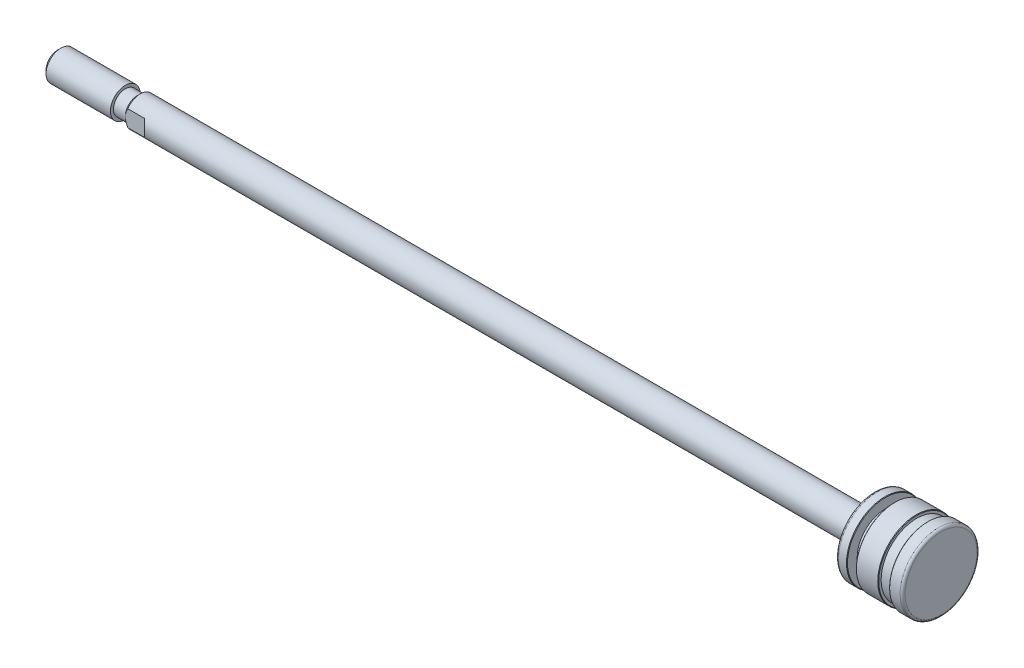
ISO-10303-21;
HEADER;
FILE_DESCRIPTION(('STEP AP214'),'2;1');
FILE_NAME('part.step','',(''),(''),'','','');
FILE_SCHEMA(('AUTOMOTIVE_DESIGN { 1 0 10303 214 1 1 1 1 }'));
ENDSEC;
DATA;
#1=APPLICATION_CONTEXT('core data for automotive mechanical design processes');
#2=APPLICATION_PROTOCOL_DEFINITION('international standard','automotive_design',2000,#1);
#3=PRODUCT_CONTEXT('',#1,'mechanical');
#4=PRODUCT('Part','Part','',(#3));
#5=PRODUCT_RELATED_PRODUCT_CATEGORY('part','',(#4));
#6=PRODUCT_DEFINITION_FORMATION('','',#4);
#7=PRODUCT_DEFINITION_CONTEXT('part definition',#1,'design');
#8=PRODUCT_DEFINITION('design','',#6,#7);
#9=PRODUCT_DEFINITION_SHAPE('','',#8);
#10=(LENGTH_UNIT() NAMED_UNIT(*) SI_UNIT(.MILLI.,.METRE.));
#11=(NAMED_UNIT(*) PLANE_ANGLE_UNIT() SI_UNIT($,.RADIAN.));
#12=(NAMED_UNIT(*) SI_UNIT($,.STERADIAN.) SOLID_ANGLE_UNIT());
#13=UNCERTAINTY_MEASURE_WITH_UNIT(LENGTH_MEASURE(1.E-05),#10,'distance_accuracy_value','');
#14=(GEOMETRIC_REPRESENTATION_CONTEXT(3) GLOBAL_UNCERTAINTY_ASSIGNED_CONTEXT((#13)) GLOBAL_UNIT_ASSIGNED_CONTEXT((#10,
#11,#12)) REPRESENTATION_CONTEXT('',''));
#15=CARTESIAN_POINT('',(0.,0.,0.));
#16=DIRECTION('',(0.,0.,1.));
#17=DIRECTION('',(1.,0.,0.));
#18=AXIS2_PLACEMENT_3D('',#15,#16,#17);
#19=CARTESIAN_POINT('',(140.,7.25,0.));
#20=DIRECTION('',(-1.,0.,0.));
#21=DIRECTION('',(0.,0.,1.));
#22=AXIS2_PLACEMENT_3D('',#19,#20,#21);
#23=PLANE('',#22);
#24=CARTESIAN_POINT('',(140.,0.,0.));
#25=DIRECTION('',(-1.,0.,0.));
#26=DIRECTION('',(0.,0.,-1.));
#27=AXIS2_PLACEMENT_3D('',#24,#25,#26);
#28=CIRCLE('',#27,7.25);
#29=CARTESIAN_POINT('',(140.,0.,-7.25));
#30=VERTEX_POINT('',#29);
#31=CARTESIAN_POINT('',(140.,0.,7.25));
#32=VERTEX_POINT('',#31);
#33=EDGE_CURVE('E237',#30,#32,#28,.T.);
#34=ORIENTED_EDGE('',*,*,#33,.F.);
#35=CARTESIAN_POINT('',(140.,0.,0.));
#36=DIRECTION('',(-1.,0.,0.));
#37=DIRECTION('',(0.,0.,1.));
#38=AXIS2_PLACEMENT_3D('',#35,#36,#37);
#39=CIRCLE('',#38,7.25);
#40=EDGE_CURVE('E539',#32,#30,#39,.T.);
#41=ORIENTED_EDGE('',*,*,#40,.F.);
#42=EDGE_LOOP('',(#34,#41));
#43=FACE_BOUND('',#42,.T.);
#44=ADVANCED_FACE('F17',(#43),#23,.F.);
#45=CARTESIAN_POINT('',(139.5,0.,0.));
#46=DIRECTION('',(-1.,0.,0.));
#47=DIRECTION('',(0.,0.,1.));
#48=AXIS2_PLACEMENT_3D('',#45,#46,#47);
#49=TOROIDAL_SURFACE('',#48,7.25,0.500000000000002);
#50=ORIENTED_EDGE('',*,*,#40,.T.);
#51=ORIENTED_EDGE('',*,*,#33,.T.);
#52=EDGE_LOOP('',(#50,#51));
#53=FACE_BOUND('',#52,.T.);
#54=CARTESIAN_POINT('',(139.5,0.,0.));
#55=DIRECTION('',(-1.,0.,0.));
#56=DIRECTION('',(0.,0.,1.));
#57=AXIS2_PLACEMENT_3D('',#54,#55,#56);
#58=CIRCLE('',#57,7.75);
#59=CARTESIAN_POINT('',(139.5,0.,7.75));
#60=VERTEX_POINT('',#59);
#61=EDGE_CURVE('E234',#60,#60,#58,.T.);
#62=ORIENTED_EDGE('',*,*,#61,.F.);
#63=EDGE_LOOP('',(#62));
#64=FACE_BOUND('',#63,.T.);
#65=ADVANCED_FACE('F242',(#53,#64),#49,.T.);
#66=CARTESIAN_POINT('',(140.,0.,0.));
#67=DIRECTION('',(-1.,0.,0.));
#68=DIRECTION('',(0.,0.,1.));
#69=AXIS2_PLACEMENT_3D('',#66,#67,#68);
#70=CYLINDRICAL_SURFACE('',#69,7.75);
#71=ORIENTED_EDGE('',*,*,#61,.T.);
#72=EDGE_LOOP('',(#71));
#73=FACE_BOUND('',#72,.T.);
#74=CARTESIAN_POINT('',(137.4,0.,0.));
#75=DIRECTION('',(1.,0.,0.));
#76=DIRECTION('',(0.,0.,-1.));
#77=AXIS2_PLACEMENT_3D('',#74,#75,#76);
#78=CIRCLE('',#77,7.75);
#79=CARTESIAN_POINT('',(137.4,0.,-7.75));
#80=VERTEX_POINT('',#79);
#81=EDGE_CURVE('E225',#80,#80,#78,.F.);
#82=ORIENTED_EDGE('',*,*,#81,.F.);
#83=EDGE_LOOP('',(#82));
#84=FACE_BOUND('',#83,.T.);
#85=ADVANCED_FACE('F246',(#73,#84),#70,.T.);
#86=CARTESIAN_POINT('',(137.4,0.,0.));
#87=DIRECTION('',(1.,0.,0.));
#88=DIRECTION('',(0.,0.,-1.));
#89=AXIS2_PLACEMENT_3D('',#86,#87,#88);
#90=CONICAL_SURFACE('',#89,7.75,0.785398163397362);
#91=CARTESIAN_POINT('',(137.3,0.,0.));
#92=DIRECTION('',(1.,0.,0.));
#93=DIRECTION('',(0.,0.,-1.));
#94=AXIS2_PLACEMENT_3D('',#91,#92,#93);
#95=CIRCLE('',#94,7.65);
#96=CARTESIAN_POINT('',(137.3,0.,-7.65));
#97=VERTEX_POINT('',#96);
#98=EDGE_CURVE('E233',#97,#97,#95,.T.);
#99=ORIENTED_EDGE('',*,*,#98,.T.);
#100=EDGE_LOOP('',(#99));
#101=FACE_BOUND('',#100,.T.);
#102=ORIENTED_EDGE('',*,*,#81,.T.);
#103=EDGE_LOOP('',(#102));
#104=FACE_BOUND('',#103,.T.);
#105=ADVANCED_FACE('F501',(#101,#104),#90,.T.);
#106=CARTESIAN_POINT('',(137.3,7.27,0.));
#107=DIRECTION('',(1.,0.,0.));
#108=DIRECTION('',(0.,0.,-1.));
#109=AXIS2_PLACEMENT_3D('',#106,#107,#108);
#110=PLANE('',#109);
#111=ORIENTED_EDGE('',*,*,#98,.F.);
#112=EDGE_LOOP('',(#111));
#113=FACE_BOUND('',#112,.T.);
#114=CARTESIAN_POINT('',(137.3,0.,0.));
#115=DIRECTION('',(-1.,0.,0.));
#116=DIRECTION('',(0.,0.,-1.));
#117=AXIS2_PLACEMENT_3D('',#114,#115,#116);
#118=CIRCLE('',#117,7.27);
#119=CARTESIAN_POINT('',(137.3,0.,7.27));
#120=VERTEX_POINT('',#119);
#121=CARTESIAN_POINT('',(137.3,0.,-7.27));
#122=VERTEX_POINT('',#121);
#123=EDGE_CURVE('E171',#120,#122,#118,.F.);
#124=ORIENTED_EDGE('',*,*,#123,.T.);
#125=CARTESIAN_POINT('',(137.3,0.,0.));
#126=DIRECTION('',(-1.,0.,0.));
#127=DIRECTION('',(0.,0.,1.));
#128=AXIS2_PLACEMENT_3D('',#125,#126,#127);
#129=CIRCLE('',#128,7.27);
#130=EDGE_CURVE('E213',#122,#120,#129,.F.);
#131=ORIENTED_EDGE('',*,*,#130,.T.);
#132=EDGE_LOOP('',(#124,#131));
#133=FACE_BOUND('',#132,.T.);
#134=ADVANCED_FACE('F188',(#113,#133),#110,.F.);
#135=CARTESIAN_POINT('',(137.2,0.,0.));
#136=DIRECTION('',(-1.,0.,0.));
#137=DIRECTION('',(0.,0.,1.));
#138=AXIS2_PLACEMENT_3D('',#135,#136,#137);
#139=TOROIDAL_SURFACE('',#138,7.27,0.099999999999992);
#140=CARTESIAN_POINT('',(137.2,0.,0.));
#141=DIRECTION('',(-1.,0.,0.));
#142=DIRECTION('',(0.,0.,1.));
#143=AXIS2_PLACEMENT_3D('',#140,#141,#142);
#144=CIRCLE('',#143,7.17);
#145=CARTESIAN_POINT('',(137.2,0.,7.17));
#146=VERTEX_POINT('',#145);
#147=EDGE_CURVE('E198',#146,#146,#144,.T.);
#148=ORIENTED_EDGE('',*,*,#147,.F.);
#149=EDGE_LOOP('',(#148));
#150=FACE_BOUND('',#149,.T.);
#151=ORIENTED_EDGE('',*,*,#123,.F.);
#152=ORIENTED_EDGE('',*,*,#130,.F.);
#153=EDGE_LOOP('',(#151,#152));
#154=FACE_BOUND('',#153,.T.);
#155=ADVANCED_FACE('F176',(#150,#154),#139,.F.);
#156=CARTESIAN_POINT('',(140.,0.,0.));
#157=DIRECTION('',(-1.,0.,0.));
#158=DIRECTION('',(0.,0.,1.));
#159=AXIS2_PLACEMENT_3D('',#156,#157,#158);
#160=CYLINDRICAL_SURFACE('',#159,7.17);
#161=CARTESIAN_POINT('',(135.1,0.,0.));
#162=DIRECTION('',(-1.,0.,0.));
#163=DIRECTION('',(0.,0.,1.));
#164=AXIS2_PLACEMENT_3D('',#161,#162,#163);
#165=CIRCLE('',#164,7.17);
#166=CARTESIAN_POINT('',(135.1,0.,7.17));
#167=VERTEX_POINT('',#166);
#168=EDGE_CURVE('E576',#167,#167,#165,.F.);
#169=ORIENTED_EDGE('',*,*,#168,.T.);
#170=EDGE_LOOP('',(#169));
#171=FACE_BOUND('',#170,.T.);
#172=ORIENTED_EDGE('',*,*,#147,.T.);
#173=EDGE_LOOP('',(#172));
#174=FACE_BOUND('',#173,.T.);
#175=ADVANCED_FACE('F187',(#171,#174),#160,.T.);
#176=CARTESIAN_POINT('',(135.1,7.65,0.));
#177=DIRECTION('',(-1.,0.,0.));
#178=DIRECTION('',(0.,0.,1.));
#179=AXIS2_PLACEMENT_3D('',#176,#177,#178);
#180=PLANE('',#179);
#181=ORIENTED_EDGE('',*,*,#168,.F.);
#182=EDGE_LOOP('',(#181));
#183=FACE_BOUND('',#182,.T.);
#184=CARTESIAN_POINT('',(135.1,0.,0.));
#185=DIRECTION('',(-1.,0.,0.));
#186=DIRECTION('',(0.,0.,1.));
#187=AXIS2_PLACEMENT_3D('',#184,#185,#186);
#188=CIRCLE('',#187,7.65);
#189=CARTESIAN_POINT('',(135.1,0.,7.65));
#190=VERTEX_POINT('',#189);
#191=EDGE_CURVE('E573',#190,#190,#188,.T.);
#192=ORIENTED_EDGE('',*,*,#191,.F.);
#193=EDGE_LOOP('',(#192));
#194=FACE_BOUND('',#193,.T.);
#195=ADVANCED_FACE('F469',(#183,#194),#180,.F.);
#196=CARTESIAN_POINT('',(135.,0.,0.));
#197=DIRECTION('',(-1.,0.,0.));
#198=DIRECTION('',(0.,0.,1.));
#199=AXIS2_PLACEMENT_3D('',#196,#197,#198);
#200=CONICAL_SURFACE('',#199,7.75,0.7853981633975);
#201=ORIENTED_EDGE('',*,*,#191,.T.);
#202=EDGE_LOOP('',(#201));
#203=FACE_BOUND('',#202,.T.);
#204=CARTESIAN_POINT('',(135.,0.,0.));
#205=DIRECTION('',(-1.,0.,0.));
#206=DIRECTION('',(0.,0.,1.));
#207=AXIS2_PLACEMENT_3D('',#204,#205,#206);
#208=CIRCLE('',#207,7.75);
#209=CARTESIAN_POINT('',(135.,0.,7.75));
#210=VERTEX_POINT('',#209);
#211=EDGE_CURVE('E571',#210,#210,#208,.T.);
#212=ORIENTED_EDGE('',*,*,#211,.F.);
#213=EDGE_LOOP('',(#212));
#214=FACE_BOUND('',#213,.T.);
#215=ADVANCED_FACE('F459',(#203,#214),#200,.T.);
#216=CARTESIAN_POINT('',(140.,0.,0.));
#217=DIRECTION('',(-1.,0.,0.));
#218=DIRECTION('',(0.,0.,1.));
#219=AXIS2_PLACEMENT_3D('',#216,#217,#218);
#220=CYLINDRICAL_SURFACE('',#219,7.75);
#221=ORIENTED_EDGE('',*,*,#211,.T.);
#222=EDGE_LOOP('',(#221));
#223=FACE_BOUND('',#222,.T.);
#224=CARTESIAN_POINT('',(130.7,0.,0.));
#225=DIRECTION('',(1.,0.,0.));
#226=DIRECTION('',(0.,0.,-1.));
#227=AXIS2_PLACEMENT_3D('',#224,#225,#226);
#228=CIRCLE('',#227,7.75);
#229=CARTESIAN_POINT('',(130.7,0.,-7.75));
#230=VERTEX_POINT('',#229);
#231=EDGE_CURVE('E568',#230,#230,#228,.F.);
#232=ORIENTED_EDGE('',*,*,#231,.F.);
#233=EDGE_LOOP('',(#232));
#234=FACE_BOUND('',#233,.T.);
#235=ADVANCED_FACE('F449',(#223,#234),#220,.T.);
#236=CARTESIAN_POINT('',(130.7,0.,0.));
#237=DIRECTION('',(1.,0.,0.));
#238=DIRECTION('',(0.,0.,-1.));
#239=AXIS2_PLACEMENT_3D('',#236,#237,#238);
#240=CONICAL_SURFACE('',#239,7.75,0.7853981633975);
#241=CARTESIAN_POINT('',(130.6,0.,0.));
#242=DIRECTION('',(1.,0.,0.));
#243=DIRECTION('',(0.,0.,-1.));
#244=AXIS2_PLACEMENT_3D('',#241,#242,#243);
#245=CIRCLE('',#244,7.65);
#246=CARTESIAN_POINT('',(130.6,0.,-7.65));
#247=VERTEX_POINT('',#246);
#248=EDGE_CURVE('E570',#247,#247,#245,.T.);
#249=ORIENTED_EDGE('',*,*,#248,.T.);
#250=EDGE_LOOP('',(#249));
#251=FACE_BOUND('',#250,.T.);
#252=ORIENTED_EDGE('',*,*,#231,.T.);
#253=EDGE_LOOP('',(#252));
#254=FACE_BOUND('',#253,.T.);
#255=ADVANCED_FACE('F439',(#251,#254),#240,.T.);
#256=CARTESIAN_POINT('',(130.6,5.7,0.));
#257=DIRECTION('',(1.,0.,0.));
#258=DIRECTION('',(0.,0.,-1.));
#259=AXIS2_PLACEMENT_3D('',#256,#257,#258);
#260=PLANE('',#259);
#261=ORIENTED_EDGE('',*,*,#248,.F.);
#262=EDGE_LOOP('',(#261));
#263=FACE_BOUND('',#262,.T.);
#264=CARTESIAN_POINT('',(130.6,0.,0.));
#265=DIRECTION('',(-1.,0.,0.));
#266=DIRECTION('',(0.,0.,1.));
#267=AXIS2_PLACEMENT_3D('',#264,#265,#266);
#268=CIRCLE('',#267,5.7);
#269=CARTESIAN_POINT('',(130.6,0.,5.7));
#270=VERTEX_POINT('',#269);
#271=EDGE_CURVE('E589',#270,#270,#268,.T.);
#272=ORIENTED_EDGE('',*,*,#271,.F.);
#273=EDGE_LOOP('',(#272));
#274=FACE_BOUND('',#273,.T.);
#275=ADVANCED_FACE('F429',(#263,#274),#260,.F.);
#276=CARTESIAN_POINT('',(140.,0.,0.));
#277=DIRECTION('',(-1.,0.,0.));
#278=DIRECTION('',(0.,0.,1.));
#279=AXIS2_PLACEMENT_3D('',#276,#277,#278);
#280=CYLINDRICAL_SURFACE('',#279,5.7);
#281=CARTESIAN_POINT('',(128.8,0.,0.));
#282=DIRECTION('',(-1.,0.,0.));
#283=DIRECTION('',(0.,0.,1.));
#284=AXIS2_PLACEMENT_3D('',#281,#282,#283);
#285=CIRCLE('',#284,5.7);
#286=CARTESIAN_POINT('',(128.8,0.,5.7));
#287=VERTEX_POINT('',#286);
#288=EDGE_CURVE('E592',#287,#287,#285,.F.);
#289=ORIENTED_EDGE('',*,*,#288,.T.);
#290=EDGE_LOOP('',(#289));
#291=FACE_BOUND('',#290,.T.);
#292=ORIENTED_EDGE('',*,*,#271,.T.);
#293=EDGE_LOOP('',(#292));
#294=FACE_BOUND('',#293,.T.);
#295=ADVANCED_FACE('F419',(#291,#294),#280,.T.);
#296=CARTESIAN_POINT('',(128.8,7.65,0.));
#297=DIRECTION('',(-1.,0.,0.));
#298=DIRECTION('',(0.,0.,1.));
#299=AXIS2_PLACEMENT_3D('',#296,#297,#298);
#300=PLANE('',#299);
#301=ORIENTED_EDGE('',*,*,#288,.F.);
#302=EDGE_LOOP('',(#301));
#303=FACE_BOUND('',#302,.T.);
#304=CARTESIAN_POINT('',(128.8,0.,0.));
#305=DIRECTION('',(-1.,0.,0.));
#306=DIRECTION('',(0.,0.,1.));
#307=AXIS2_PLACEMENT_3D('',#304,#305,#306);
#308=CIRCLE('',#307,7.65);
#309=CARTESIAN_POINT('',(128.8,0.,7.65));
#310=VERTEX_POINT('',#309);
#311=EDGE_CURVE('E567',#310,#310,#308,.T.);
#312=ORIENTED_EDGE('',*,*,#311,.F.);
#313=EDGE_LOOP('',(#312));
#314=FACE_BOUND('',#313,.T.);
#315=ADVANCED_FACE('F409',(#303,#314),#300,.F.);
#316=CARTESIAN_POINT('',(128.7,0.,0.));
#317=DIRECTION('',(-1.,0.,0.));
#318=DIRECTION('',(0.,0.,1.));
#319=AXIS2_PLACEMENT_3D('',#316,#317,#318);
#320=CONICAL_SURFACE('',#319,7.75,0.785398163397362);
#321=CARTESIAN_POINT('',(128.7,0.,0.));
#322=DIRECTION('',(-1.,0.,0.));
#323=DIRECTION('',(0.,0.,1.));
#324=AXIS2_PLACEMENT_3D('',#321,#322,#323);
#325=CIRCLE('',#324,7.75);
#326=CARTESIAN_POINT('',(128.7,0.,7.75));
#327=VERTEX_POINT('',#326);
#328=EDGE_CURVE('E564',#327,#327,#325,.T.);
#329=ORIENTED_EDGE('',*,*,#328,.F.);
#330=EDGE_LOOP('',(#329));
#331=FACE_BOUND('',#330,.T.);
#332=ORIENTED_EDGE('',*,*,#311,.T.);
#333=EDGE_LOOP('',(#332));
#334=FACE_BOUND('',#333,.T.);
#335=ADVANCED_FACE('F399',(#331,#334),#320,.T.);
#336=CARTESIAN_POINT('',(-38.,0.,0.));
#337=DIRECTION('',(1.,0.,0.));
#338=DIRECTION('',(0.,0.,-1.));
#339=AXIS2_PLACEMENT_3D('',#336,#337,#338);
#340=PLANE('',#339);
#341=CARTESIAN_POINT('',(-38.0000000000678,0.,0.));
#342=DIRECTION('',(1.,0.,0.));
#343=DIRECTION('',(0.,0.,-1.));
#344=AXIS2_PLACEMENT_3D('',#341,#342,#343);
#345=CIRCLE('',#344,2.38650000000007);
#346=CARTESIAN_POINT('',(-38.0000000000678,0.,-2.38650000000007));
#347=VERTEX_POINT('',#346);
#348=EDGE_CURVE('E561',#347,#347,#345,.T.);
#349=ORIENTED_EDGE('',*,*,#348,.F.);
#350=EDGE_LOOP('',(#349));
#351=FACE_BOUND('',#350,.T.);
#352=ADVANCED_FACE('F390',(#351),#340,.F.);
#353=CARTESIAN_POINT('',(140.,0.,0.));
#354=DIRECTION('',(-1.,0.,0.));
#355=DIRECTION('',(0.,0.,1.));
#356=AXIS2_PLACEMENT_3D('',#353,#354,#355);
#357=CYLINDRICAL_SURFACE('',#356,7.75);
#358=CARTESIAN_POINT('',(127.1,0.,0.));
#359=DIRECTION('',(-1.,0.,0.));
#360=DIRECTION('',(0.,0.,1.));
#361=AXIS2_PLACEMENT_3D('',#358,#359,#360);
#362=CIRCLE('',#361,7.75000000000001);
#363=CARTESIAN_POINT('',(127.1,0.,7.75000000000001));
#364=VERTEX_POINT('',#363);
#365=EDGE_CURVE('E558',#364,#364,#362,.T.);
#366=ORIENTED_EDGE('',*,*,#365,.F.);
#367=EDGE_LOOP('',(#366));
#368=FACE_BOUND('',#367,.T.);
#369=ORIENTED_EDGE('',*,*,#328,.T.);
#370=EDGE_LOOP('',(#369));
#371=FACE_BOUND('',#370,.T.);
#372=ADVANCED_FACE('F381',(#368,#371),#357,.T.);
#373=CARTESIAN_POINT('',(-37.3865000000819,0.,0.));
#374=DIRECTION('',(1.,0.,0.));
#375=DIRECTION('',(0.,0.,-1.));
#376=AXIS2_PLACEMENT_3D('',#373,#374,#375);
#377=CONICAL_SURFACE('',#376,2.9999999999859,0.785398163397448);
#378=CARTESIAN_POINT('',(-37.3865,0.,0.));
#379=DIRECTION('',(-1.,0.,0.));
#380=DIRECTION('',(0.,0.,1.));
#381=AXIS2_PLACEMENT_3D('',#378,#379,#380);
#382=CIRCLE('',#381,3.);
#383=CARTESIAN_POINT('',(-37.3865,0.,3.));
#384=VERTEX_POINT('',#383);
#385=EDGE_CURVE('E556',#384,#384,#382,.F.);
#386=ORIENTED_EDGE('',*,*,#385,.F.);
#387=EDGE_LOOP('',(#386));
#388=FACE_BOUND('',#387,.T.);
#389=ORIENTED_EDGE('',*,*,#348,.T.);
#390=EDGE_LOOP('',(#389));
#391=FACE_BOUND('',#390,.T.);
#392=ADVANCED_FACE('F147',(#388,#391),#377,.T.);
#393=CARTESIAN_POINT('',(127.1,0.,0.));
#394=DIRECTION('',(-1.,0.,0.));
#395=DIRECTION('',(0.,0.,1.));
#396=AXIS2_PLACEMENT_3D('',#393,#394,#395);
#397=TOROIDAL_SURFACE('',#396,7.24999999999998,0.500000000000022);
#398=CARTESIAN_POINT('',(126.6,0.,0.));
#399=DIRECTION('',(1.,0.,0.));
#400=DIRECTION('',(0.,0.,1.));
#401=AXIS2_PLACEMENT_3D('',#398,#399,#400);
#402=CIRCLE('',#401,7.24999999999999);
#403=CARTESIAN_POINT('',(126.6,0.,7.25));
#404=VERTEX_POINT('',#403);
#405=CARTESIAN_POINT('',(126.6,0.,-7.25));
#406=VERTEX_POINT('',#405);
#407=EDGE_CURVE('E110',#404,#406,#402,.T.);
#408=ORIENTED_EDGE('',*,*,#407,.T.);
#409=CARTESIAN_POINT('',(126.6,0.,0.));
#410=DIRECTION('',(1.,0.,0.));
#411=DIRECTION('',(0.,0.,-1.));
#412=AXIS2_PLACEMENT_3D('',#409,#410,#411);
#413=CIRCLE('',#412,7.24999999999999);
#414=EDGE_CURVE('E550',#406,#404,#413,.T.);
#415=ORIENTED_EDGE('',*,*,#414,.T.);
#416=EDGE_LOOP('',(#408,#415));
#417=FACE_BOUND('',#416,.T.);
#418=ORIENTED_EDGE('',*,*,#365,.T.);
#419=EDGE_LOOP('',(#418));
#420=FACE_BOUND('',#419,.T.);
#421=ADVANCED_FACE('F143',(#417,#420),#397,.T.);
#422=CARTESIAN_POINT('',(140.,0.,0.));
#423=DIRECTION('',(-1.,0.,0.));
#424=DIRECTION('',(0.,0.,1.));
#425=AXIS2_PLACEMENT_3D('',#422,#423,#424);
#426=CYLINDRICAL_SURFACE('',#425,3.);
#427=ORIENTED_EDGE('',*,*,#385,.T.);
#428=EDGE_LOOP('',(#427));
#429=FACE_BOUND('',#428,.T.);
#430=CARTESIAN_POINT('',(-24.4,0.,0.));
#431=DIRECTION('',(-1.,0.,0.));
#432=DIRECTION('',(0.,0.,1.));
#433=AXIS2_PLACEMENT_3D('',#430,#431,#432);
#434=CIRCLE('',#433,3.);
#435=CARTESIAN_POINT('',(-24.4,0.,3.));
#436=VERTEX_POINT('',#435);
#437=EDGE_CURVE('E552',#436,#436,#434,.T.);
#438=ORIENTED_EDGE('',*,*,#437,.T.);
#439=EDGE_LOOP('',(#438));
#440=FACE_BOUND('',#439,.T.);
#441=ADVANCED_FACE('F127',(#429,#440),#426,.T.);
#442=CARTESIAN_POINT('',(126.6,2.9,0.));
#443=DIRECTION('',(1.,0.,0.));
#444=DIRECTION('',(0.,0.,-1.));
#445=AXIS2_PLACEMENT_3D('',#442,#443,#444);
#446=PLANE('',#445);
#447=ORIENTED_EDGE('',*,*,#407,.F.);
#448=ORIENTED_EDGE('',*,*,#414,.F.);
#449=EDGE_LOOP('',(#447,#448));
#450=FACE_BOUND('',#449,.T.);
#451=CARTESIAN_POINT('',(126.6,0.,0.));
#452=DIRECTION('',(-1.,0.,0.));
#453=DIRECTION('',(0.,0.,1.));
#454=AXIS2_PLACEMENT_3D('',#451,#452,#453);
#455=CIRCLE('',#454,2.9);
#456=CARTESIAN_POINT('',(126.6,0.,2.9));
#457=VERTEX_POINT('',#456);
#458=EDGE_CURVE('E554',#457,#457,#455,.T.);
#459=ORIENTED_EDGE('',*,*,#458,.F.);
#460=EDGE_LOOP('',(#459));
#461=FACE_BOUND('',#460,.T.);
#462=ADVANCED_FACE('F116',(#450,#461),#446,.F.);
#463=CARTESIAN_POINT('',(-24.4,3.,0.));
#464=DIRECTION('',(-1.,0.,0.));
#465=DIRECTION('',(0.,0.,1.));
#466=AXIS2_PLACEMENT_3D('',#463,#464,#465);
#467=PLANE('',#466);
#468=CARTESIAN_POINT('',(-24.4,0.,0.));
#469=DIRECTION('',(-1.,0.,0.));
#470=DIRECTION('',(0.,0.,1.));
#471=AXIS2_PLACEMENT_3D('',#468,#469,#470);
#472=CIRCLE('',#471,2.4);
#473=CARTESIAN_POINT('',(-24.4,0.,2.4));
#474=VERTEX_POINT('',#473);
#475=EDGE_CURVE('E601',#474,#474,#472,.F.);
#476=ORIENTED_EDGE('',*,*,#475,.F.);
#477=EDGE_LOOP('',(#476));
#478=FACE_BOUND('',#477,.T.);
#479=ORIENTED_EDGE('',*,*,#437,.F.);
#480=EDGE_LOOP('',(#479));
#481=FACE_BOUND('',#480,.T.);
#482=ADVANCED_FACE('F126',(#478,#481),#467,.F.);
#483=CARTESIAN_POINT('',(140.,0.,0.));
#484=DIRECTION('',(-1.,0.,0.));
#485=DIRECTION('',(0.,0.,1.));
#486=AXIS2_PLACEMENT_3D('',#483,#484,#485);
#487=CYLINDRICAL_SURFACE('',#486,2.9);
#488=CARTESIAN_POINT('',(124.1,0.,0.));
#489=DIRECTION('',(-1.,0.,0.));
#490=DIRECTION('',(0.,0.,1.));
#491=AXIS2_PLACEMENT_3D('',#488,#489,#490);
#492=CIRCLE('',#491,2.9);
#493=CARTESIAN_POINT('',(124.1,0.,2.9));
#494=VERTEX_POINT('',#493);
#495=EDGE_CURVE('E100',#494,#494,#492,.F.);
#496=ORIENTED_EDGE('',*,*,#495,.T.);
#497=EDGE_LOOP('',(#496));
#498=FACE_BOUND('',#497,.T.);
#499=ORIENTED_EDGE('',*,*,#458,.T.);
#500=EDGE_LOOP('',(#499));
#501=FACE_BOUND('',#500,.T.);
#502=ADVANCED_FACE('F292',(#498,#501),#487,.T.);
#503=CARTESIAN_POINT('',(140.,0.,0.));
#504=DIRECTION('',(-1.,0.,0.));
#505=DIRECTION('',(0.,0.,1.));
#506=AXIS2_PLACEMENT_3D('',#503,#504,#505);
#507=CYLINDRICAL_SURFACE('',#506,2.4);
#508=ORIENTED_EDGE('',*,*,#475,.T.);
#509=EDGE_LOOP('',(#508));
#510=FACE_BOUND('',#509,.T.);
#511=CARTESIAN_POINT('',(-21.9999999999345,0.,0.));
#512=DIRECTION('',(1.,0.,0.));
#513=DIRECTION('',(0.,0.,-1.));
#514=AXIS2_PLACEMENT_3D('',#511,#512,#513);
#515=CIRCLE('',#514,2.39999999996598);
#516=CARTESIAN_POINT('',(-21.9999999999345,0.,-2.39999999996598));
#517=VERTEX_POINT('',#516);
#518=EDGE_CURVE('E75',#517,#517,#515,.T.);
#519=ORIENTED_EDGE('',*,*,#518,.F.);
#520=EDGE_LOOP('',(#519));
#521=FACE_BOUND('',#520,.T.);
#522=ADVANCED_FACE('F289',(#510,#521),#507,.T.);
#523=CARTESIAN_POINT('',(124.1,3.,0.));
#524=DIRECTION('',(-1.,0.,0.));
#525=DIRECTION('',(0.,0.,1.));
#526=AXIS2_PLACEMENT_3D('',#523,#524,#525);
#527=PLANE('',#526);
#528=ORIENTED_EDGE('',*,*,#495,.F.);
#529=EDGE_LOOP('',(#528));
#530=FACE_BOUND('',#529,.T.);
#531=CARTESIAN_POINT('',(124.1,0.,0.));
#532=DIRECTION('',(-1.,0.,0.));
#533=DIRECTION('',(0.,0.,1.));
#534=AXIS2_PLACEMENT_3D('',#531,#532,#533);
#535=CIRCLE('',#534,3.);
#536=CARTESIAN_POINT('',(124.1,0.,3.));
#537=VERTEX_POINT('',#536);
#538=EDGE_CURVE('E88',#537,#537,#535,.T.);
#539=ORIENTED_EDGE('',*,*,#538,.F.);
#540=EDGE_LOOP('',(#539));
#541=FACE_BOUND('',#540,.T.);
#542=ADVANCED_FACE('F285',(#530,#541),#527,.F.);
#543=CARTESIAN_POINT('',(-18.,-6.,-2.5));
#544=DIRECTION('',(0.707106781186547,0.,0.707106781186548));
#545=DIRECTION('',(0.707106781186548,0.,-0.707106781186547));
#546=AXIS2_PLACEMENT_3D('',#543,#544,#545);
#547=PLANE('',#546);
#548=CARTESIAN_POINT('',(-20.5,0.,0.));
#549=DIRECTION('',(0.707106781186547,0.,0.707106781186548));
#550=DIRECTION('',(-0.707106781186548,0.,0.707106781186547));
#551=AXIS2_PLACEMENT_3D('',#548,#549,#550);
#552=ELLIPSE('',#551,4.24264068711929,3.);
#553=CARTESIAN_POINT('',(-18.,-1.6583123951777,-2.5));
#554=VERTEX_POINT('',#553);
#555=CARTESIAN_POINT('',(-18.,1.6583123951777,-2.5));
#556=VERTEX_POINT('',#555);
#557=EDGE_CURVE('E86',#554,#556,#552,.T.);
#558=ORIENTED_EDGE('',*,*,#557,.F.);
#559=DIRECTION('',(0.,1.,0.));
#560=VECTOR('',#559,1.);
#561=CARTESIAN_POINT('',(-18.,-6.,-2.5));
#562=LINE('',#561,#560);
#563=EDGE_CURVE('E98',#554,#556,#562,.T.);
#564=ORIENTED_EDGE('',*,*,#563,.T.);
#565=EDGE_LOOP('',(#558,#564));
#566=FACE_BOUND('',#565,.T.);
#567=ADVANCED_FACE('F282',(#566),#547,.F.);
#568=CARTESIAN_POINT('',(-22.,-6.,-2.5));
#569=DIRECTION('',(0.,0.,1.));
#570=DIRECTION('',(1.,0.,0.));
#571=AXIS2_PLACEMENT_3D('',#568,#569,#570);
#572=PLANE('',#571);
#573=DIRECTION('',(-1.,0.,0.));
#574=VECTOR('',#573,1.);
#575=CARTESIAN_POINT('',(140.,-1.6583123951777,-2.5));
#576=LINE('',#575,#574);
#577=CARTESIAN_POINT('',(-21.3999999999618,-1.65831239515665,-2.5));
#578=VERTEX_POINT('',#577);
#579=EDGE_CURVE('E70',#578,#554,#576,.F.);
#580=ORIENTED_EDGE('',*,*,#579,.F.);
#581=CARTESIAN_POINT('',(-21.3999999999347,1.65831239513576,-2.500000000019));
#582=CARTESIAN_POINT('',(-21.4245861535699,1.61382941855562,-2.500000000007));
#583=CARTESIAN_POINT('',(-21.4486501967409,1.56905834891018,-2.50000000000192));
#584=CARTESIAN_POINT('',(-21.4955741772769,1.47890952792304,-2.49999999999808));
#585=CARTESIAN_POINT('',(-21.5184345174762,1.43353198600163,-2.49999999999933));
#586=CARTESIAN_POINT('',(-21.5851938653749,1.29598840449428,-2.50000000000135));
#587=CARTESIAN_POINT('',(-21.6270477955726,1.20280973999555,-2.50000000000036));
#588=CARTESIAN_POINT('',(-21.7040452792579,1.0128038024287,-2.49999999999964));
#589=CARTESIAN_POINT('',(-21.7391317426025,0.915953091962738,-2.4999999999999));
#590=CARTESIAN_POINT('',(-21.8002114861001,0.719439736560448,-2.5000000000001));
#591=CARTESIAN_POINT('',(-21.8262119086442,0.619779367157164,-2.50000000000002));
#592=CARTESIAN_POINT('',(-21.8640809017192,0.433468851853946,-2.49999999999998));
#593=CARTESIAN_POINT('',(-21.8774939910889,0.347135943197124,-2.49999999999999));
#594=CARTESIAN_POINT('',(-21.8954352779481,0.173863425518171,-2.50000000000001));
#595=CARTESIAN_POINT('',(-21.8999977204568,0.0869274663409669,-2.5));
#596=CARTESIAN_POINT('',(-21.9000019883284,-0.0758294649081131,-2.5));
#597=CARTESIAN_POINT('',(-21.8965338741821,-0.151652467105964,-2.5));
#598=CARTESIAN_POINT('',(-21.8828638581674,-0.302712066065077,-2.5));
#599=CARTESIAN_POINT('',(-21.8726593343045,-0.377948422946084,-2.5));
#600=CARTESIAN_POINT('',(-21.8459656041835,-0.527795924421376,-2.5));
#601=CARTESIAN_POINT('',(-21.8294351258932,-0.602399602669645,-2.5));
#602=CARTESIAN_POINT('',(-21.7908506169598,-0.750168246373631,-2.5));
#603=CARTESIAN_POINT('',(-21.7687950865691,-0.823332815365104,-2.5));
#604=CARTESIAN_POINT('',(-21.7219215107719,-0.962309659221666,-2.5));
#605=CARTESIAN_POINT('',(-21.6974619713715,-1.02824437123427,-2.5));
#606=CARTESIAN_POINT('',(-21.6451585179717,-1.1587606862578,-2.5));
#607=CARTESIAN_POINT('',(-21.6173140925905,-1.22334208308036,-2.5));
#608=CARTESIAN_POINT('',(-21.5591744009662,-1.35034828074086,-2.5));
#609=CARTESIAN_POINT('',(-21.5289164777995,-1.41279031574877,-2.5));
#610=CARTESIAN_POINT('',(-21.4660889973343,-1.53644034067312,-2.5));
#611=CARTESIAN_POINT('',(-21.4335213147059,-1.59764928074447,-2.5));
#612=CARTESIAN_POINT('',(-21.3999999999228,-1.65831239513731,-2.5));
#613=B_SPLINE_CURVE_WITH_KNOTS('',3,(#581,#582,#583,#584,#585,#586,#587,#588,#589,#590,#591,
#592,#593,#594,#595,#596,#597,#598,#599,#600,#601,#602,#603,#604,#605,#606,#607,#608,#609,#610,
#611,#612),.UNSPECIFIED.,.F.,.F.,(4,2,2,2,2,2,2,2,2,2,2,2,2,2,2,4),(0.,0.152469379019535,
0.304887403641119,0.611091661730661,0.919775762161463,1.22821666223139,1.48991340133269,
1.75059554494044,1.97799648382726,2.20548598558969,2.43448570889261,2.66354766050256,
2.87441784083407,3.08531991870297,3.2934288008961,3.50137066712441),.UNSPECIFIED.);
#614=CARTESIAN_POINT('',(-21.3999999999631,1.65831239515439,-2.5));
#615=VERTEX_POINT('',#614);
#616=EDGE_CURVE('E62',#615,#578,#613,.T.);
#617=ORIENTED_EDGE('',*,*,#616,.F.);
#618=DIRECTION('',(-1.,0.,0.));
#619=VECTOR('',#618,1.);
#620=CARTESIAN_POINT('',(140.,1.6583123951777,-2.5));
#621=LINE('',#620,#619);
#622=EDGE_CURVE('E67',#556,#615,#621,.T.);
#623=ORIENTED_EDGE('',*,*,#622,.F.);
#624=ORIENTED_EDGE('',*,*,#563,.F.);
#625=EDGE_LOOP('',(#580,#617,#623,#624));
#626=FACE_BOUND('',#625,.T.);
#627=ADVANCED_FACE('F64',(#626),#572,.F.);
#628=CARTESIAN_POINT('',(-21.3999999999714,0.,0.));
#629=DIRECTION('',(1.,0.,0.));
#630=DIRECTION('',(0.,0.,-1.));
#631=AXIS2_PLACEMENT_3D('',#628,#629,#630);
#632=CONICAL_SURFACE('',#631,2.99999999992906,0.785398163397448);
#633=CARTESIAN_POINT('',(-21.3999999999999,0.,0.));
#634=DIRECTION('',(-1.,0.,0.));
#635=DIRECTION('',(0.,0.,1.));
#636=AXIS2_PLACEMENT_3D('',#633,#634,#635);
#637=CIRCLE('',#636,3.);
#638=CARTESIAN_POINT('',(-21.3999999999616,-1.65831239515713,2.5));
#639=VERTEX_POINT('',#638);
#640=EDGE_CURVE('E93',#639,#578,#637,.F.);
#641=ORIENTED_EDGE('',*,*,#640,.F.);
#642=CARTESIAN_POINT('',(-21.3999999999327,-1.65831239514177,2.50000000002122));
#643=CARTESIAN_POINT('',(-21.4245861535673,-1.61382941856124,2.50000000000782));
#644=CARTESIAN_POINT('',(-21.4486501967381,-1.56905834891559,2.50000000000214));
#645=CARTESIAN_POINT('',(-21.4955741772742,-1.47890952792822,2.49999999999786));
#646=CARTESIAN_POINT('',(-21.5184345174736,-1.43353198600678,2.49999999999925));
#647=CARTESIAN_POINT('',(-21.5851938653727,-1.29598840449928,2.5000000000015));
#648=CARTESIAN_POINT('',(-21.6270477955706,-1.2028097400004,2.50000000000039));
#649=CARTESIAN_POINT('',(-21.7040452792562,-1.01280380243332,2.4999999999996));
#650=CARTESIAN_POINT('',(-21.7391317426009,-0.915953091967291,2.49999999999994));
#651=CARTESIAN_POINT('',(-21.8002114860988,-0.719439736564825,2.50000000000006));
#652=CARTESIAN_POINT('',(-21.8262119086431,-0.619779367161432,2.49999999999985));
#653=CARTESIAN_POINT('',(-21.8640809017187,-0.433468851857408,2.50000000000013));
#654=CARTESIAN_POINT('',(-21.8774939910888,-0.347135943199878,2.50000000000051));
#655=CARTESIAN_POINT('',(-21.8954352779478,-0.173863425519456,2.49999999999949));
#656=CARTESIAN_POINT('',(-21.899997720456,-0.0869274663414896,2.4999999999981));
#657=CARTESIAN_POINT('',(-21.9000019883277,0.0758294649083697,2.49999999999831));
#658=CARTESIAN_POINT('',(-21.8965338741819,0.151652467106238,2.49999999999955));
#659=CARTESIAN_POINT('',(-21.8828638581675,0.302712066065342,2.50000000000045));
#660=CARTESIAN_POINT('',(-21.8726593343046,0.377948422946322,2.50000000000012));
#661=CARTESIAN_POINT('',(-21.8459656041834,0.527795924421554,2.49999999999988));
#662=CARTESIAN_POINT('',(-21.8294351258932,0.602399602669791,2.49999999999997));
#663=CARTESIAN_POINT('',(-21.7908506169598,0.750168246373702,2.50000000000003));
#664=CARTESIAN_POINT('',(-21.7687950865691,0.823332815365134,2.50000000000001));
#665=CARTESIAN_POINT('',(-21.7219215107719,0.96230965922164,2.49999999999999));
#666=CARTESIAN_POINT('',(-21.6974619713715,1.02824437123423,2.5));
#667=CARTESIAN_POINT('',(-21.6451585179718,1.15876068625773,2.5));
#668=CARTESIAN_POINT('',(-21.6173140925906,1.22334208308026,2.5));
#669=CARTESIAN_POINT('',(-21.5591744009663,1.35034828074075,2.5));
#670=CARTESIAN_POINT('',(-21.5289164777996,1.41279031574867,2.5));
#671=CARTESIAN_POINT('',(-21.4660889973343,1.53644034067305,2.5));
#672=CARTESIAN_POINT('',(-21.4335213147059,1.59764928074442,2.5));
#673=CARTESIAN_POINT('',(-21.3999999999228,1.65831239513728,2.5));
#674=B_SPLINE_CURVE_WITH_KNOTS('',3,(#642,#643,#644,#645,#646,#647,#648,#649,#650,#651,#652,
#653,#654,#655,#656,#657,#658,#659,#660,#661,#662,#663,#664,#665,#666,#667,#668,#669,#670,#671,
#672,#673),.UNSPECIFIED.,.F.,.F.,(4,2,2,2,2,2,2,2,2,2,2,2,2,2,2,4),(0.,0.152469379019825,
0.304887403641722,0.611091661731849,0.919775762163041,1.22821666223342,1.48991340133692,
1.7505955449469,1.97799648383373,2.20548598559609,2.43448570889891,2.66354766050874,
2.8744178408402,3.08531991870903,3.29342880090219,3.50137066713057),.UNSPECIFIED.);
#675=CARTESIAN_POINT('',(-21.3999999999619,1.65831239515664,2.5));
#676=VERTEX_POINT('',#675);
#677=EDGE_CURVE('E74',#639,#676,#674,.T.);
#678=ORIENTED_EDGE('',*,*,#677,.T.);
#679=CARTESIAN_POINT('',(-21.4,0.,0.));
#680=DIRECTION('',(-1.,0.,0.));
#681=DIRECTION('',(0.,0.,1.));
#682=AXIS2_PLACEMENT_3D('',#679,#680,#681);
#683=CIRCLE('',#682,3.);
#684=EDGE_CURVE('E78',#615,#676,#683,.F.);
#685=ORIENTED_EDGE('',*,*,#684,.F.);
#686=ORIENTED_EDGE('',*,*,#616,.T.);
#687=EDGE_LOOP('',(#641,#678,#685,#686));
#688=FACE_BOUND('',#687,.T.);
#689=ORIENTED_EDGE('',*,*,#518,.T.);
#690=EDGE_LOOP('',(#689));
#691=FACE_BOUND('',#690,.T.);
#692=ADVANCED_FACE('F79',(#688,#691),#632,.T.);
#693=CARTESIAN_POINT('',(-18.,-6.,2.5));
#694=DIRECTION('',(0.,0.,-1.));
#695=DIRECTION('',(-1.,0.,0.));
#696=AXIS2_PLACEMENT_3D('',#693,#694,#695);
#697=PLANE('',#696);
#698=DIRECTION('',(-1.,0.,0.));
#699=VECTOR('',#698,1.);
#700=CARTESIAN_POINT('',(140.,1.6583123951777,2.5));
#701=LINE('',#700,#699);
#702=CARTESIAN_POINT('',(-18.,1.65831239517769,2.5));
#703=VERTEX_POINT('',#702);
#704=EDGE_CURVE('E28',#676,#703,#701,.F.);
#705=ORIENTED_EDGE('',*,*,#704,.F.);
#706=ORIENTED_EDGE('',*,*,#677,.F.);
#707=DIRECTION('',(-1.,0.,0.));
#708=VECTOR('',#707,1.);
#709=CARTESIAN_POINT('',(140.,-1.65831239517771,2.5));
#710=LINE('',#709,#708);
#711=CARTESIAN_POINT('',(-18.,-1.6583123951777,2.5));
#712=VERTEX_POINT('',#711);
#713=EDGE_CURVE('E94',#712,#639,#710,.T.);
#714=ORIENTED_EDGE('',*,*,#713,.F.);
#715=DIRECTION('',(0.,1.,0.));
#716=VECTOR('',#715,1.);
#717=CARTESIAN_POINT('',(-18.,-6.,2.5));
#718=LINE('',#717,#716);
#719=EDGE_CURVE('E37',#712,#703,#718,.T.);
#720=ORIENTED_EDGE('',*,*,#719,.T.);
#721=EDGE_LOOP('',(#705,#706,#714,#720));
#722=FACE_BOUND('',#721,.T.);
#723=ADVANCED_FACE('F273',(#722),#697,.F.);
#724=CARTESIAN_POINT('',(-13.,-6.,7.5));
#725=DIRECTION('',(0.707106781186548,0.,-0.707106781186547));
#726=DIRECTION('',(-0.707106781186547,0.,-0.707106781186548));
#727=AXIS2_PLACEMENT_3D('',#724,#725,#726);
#728=PLANE('',#727);
#729=ORIENTED_EDGE('',*,*,#719,.F.);
#730=CARTESIAN_POINT('',(-20.5,0.,0.));
#731=DIRECTION('',(0.707106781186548,0.,-0.707106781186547));
#732=DIRECTION('',(-0.707106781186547,0.,-0.707106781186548));
#733=AXIS2_PLACEMENT_3D('',#730,#731,#732);
#734=ELLIPSE('',#733,4.24264068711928,3.);
#735=EDGE_CURVE('E11',#703,#712,#734,.T.);
#736=ORIENTED_EDGE('',*,*,#735,.F.);
#737=EDGE_LOOP('',(#729,#736));
#738=FACE_BOUND('',#737,.T.);
#739=ADVANCED_FACE('F304',(#738),#728,.F.);
#740=CARTESIAN_POINT('',(140.,0.,0.));
#741=DIRECTION('',(-1.,0.,0.));
#742=DIRECTION('',(0.,0.,1.));
#743=AXIS2_PLACEMENT_3D('',#740,#741,#742);
#744=CYLINDRICAL_SURFACE('',#743,3.);
#745=ORIENTED_EDGE('',*,*,#579,.T.);
#746=ORIENTED_EDGE('',*,*,#557,.T.);
#747=ORIENTED_EDGE('',*,*,#622,.T.);
#748=ORIENTED_EDGE('',*,*,#684,.T.);
#749=ORIENTED_EDGE('',*,*,#704,.T.);
#750=ORIENTED_EDGE('',*,*,#735,.T.);
#751=ORIENTED_EDGE('',*,*,#713,.T.);
#752=ORIENTED_EDGE('',*,*,#640,.T.);
#753=EDGE_LOOP('',(#745,#746,#747,#748,#749,#750,#751,#752));
#754=FACE_BOUND('',#753,.T.);
#755=ORIENTED_EDGE('',*,*,#538,.T.);
#756=EDGE_LOOP('',(#755));
#757=FACE_BOUND('',#756,.T.);
#758=ADVANCED_FACE('F84',(#754,#757),#744,.T.);
#759=CLOSED_SHELL('',(#44,#65,#85,#105,#134,#155,#175,#195,#215,#235,#255,#275,#295,#315,#335,
#352,#372,#392,#421,#441,#462,#482,#502,#522,#542,#567,#627,#692,#723,#739,#758));
#760=MANIFOLD_SOLID_BREP('B1',#759);
#761=ADVANCED_BREP_SHAPE_REPRESENTATION('',(#18,#760),#14);
#762=SHAPE_DEFINITION_REPRESENTATION(#9,#761);
ENDSEC;
END-ISO-10303-21;
